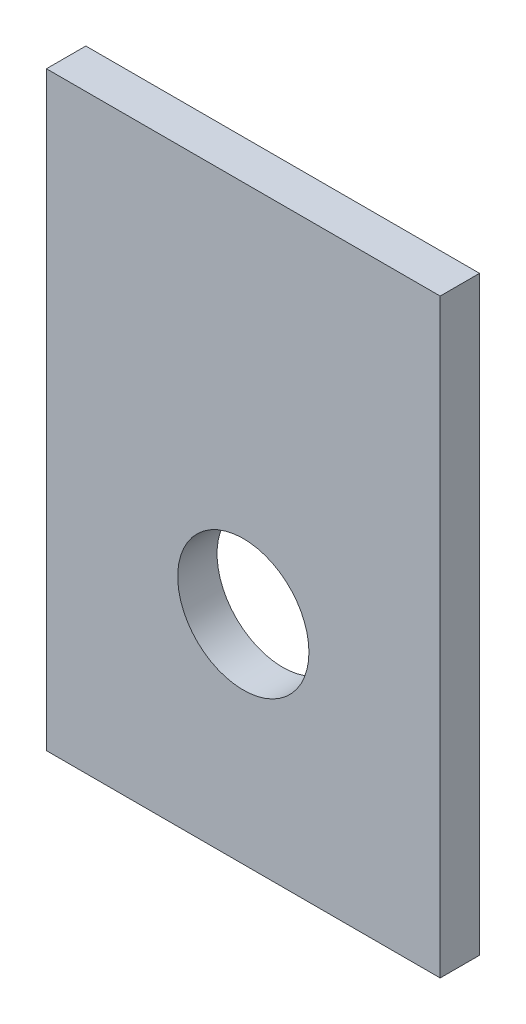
ISO-10303-21;
HEADER;
FILE_DESCRIPTION(('STEP AP214'),'2;1');
FILE_NAME('part.step','',(''),(''),'','','');
FILE_SCHEMA(('AUTOMOTIVE_DESIGN { 1 0 10303 214 1 1 1 1 }'));
ENDSEC;
DATA;
#1=APPLICATION_CONTEXT('core data for automotive mechanical design processes');
#2=APPLICATION_PROTOCOL_DEFINITION('international standard','automotive_design',2000,#1);
#3=PRODUCT_CONTEXT('',#1,'mechanical');
#4=PRODUCT('Part','Part','',(#3));
#5=PRODUCT_RELATED_PRODUCT_CATEGORY('part','',(#4));
#6=PRODUCT_DEFINITION_FORMATION('','',#4);
#7=PRODUCT_DEFINITION_CONTEXT('part definition',#1,'design');
#8=PRODUCT_DEFINITION('design','',#6,#7);
#9=PRODUCT_DEFINITION_SHAPE('','',#8);
#10=(LENGTH_UNIT() NAMED_UNIT(*) SI_UNIT(.MILLI.,.METRE.));
#11=(NAMED_UNIT(*) PLANE_ANGLE_UNIT() SI_UNIT($,.RADIAN.));
#12=(NAMED_UNIT(*) SI_UNIT($,.STERADIAN.) SOLID_ANGLE_UNIT());
#13=UNCERTAINTY_MEASURE_WITH_UNIT(LENGTH_MEASURE(1.E-05),#10,'distance_accuracy_value','');
#14=(GEOMETRIC_REPRESENTATION_CONTEXT(3) GLOBAL_UNCERTAINTY_ASSIGNED_CONTEXT((#13)) GLOBAL_UNIT_ASSIGNED_CONTEXT((#10,
#11,#12)) REPRESENTATION_CONTEXT('',''));
#15=CARTESIAN_POINT('',(0.,0.,0.));
#16=DIRECTION('',(0.,0.,1.));
#17=DIRECTION('',(1.,0.,0.));
#18=AXIS2_PLACEMENT_3D('',#15,#16,#17);
#19=CARTESIAN_POINT('',(-30.,40.,3.));
#20=DIRECTION('',(1.,0.,0.));
#21=DIRECTION('',(0.,0.,-1.));
#22=AXIS2_PLACEMENT_3D('',#19,#20,#21);
#23=PLANE('',#22);
#24=DIRECTION('',(0.,-1.,0.));
#25=VECTOR('',#24,1.);
#26=CARTESIAN_POINT('',(-30.,40.,0.));
#27=LINE('',#26,#25);
#28=CARTESIAN_POINT('',(-30.,40.,0.));
#29=VERTEX_POINT('',#28);
#30=CARTESIAN_POINT('',(-30.,-5.,0.));
#31=VERTEX_POINT('',#30);
#32=EDGE_CURVE('E71',#29,#31,#27,.T.);
#33=ORIENTED_EDGE('',*,*,#32,.T.);
#34=DIRECTION('',(0.,0.,-1.));
#35=VECTOR('',#34,1.);
#36=CARTESIAN_POINT('',(-30.,-5.,3.));
#37=LINE('',#36,#35);
#38=CARTESIAN_POINT('',(-30.,-5.,3.));
#39=VERTEX_POINT('',#38);
#40=EDGE_CURVE('E11',#39,#31,#37,.T.);
#41=ORIENTED_EDGE('',*,*,#40,.F.);
#42=DIRECTION('',(0.,-1.,0.));
#43=VECTOR('',#42,1.);
#44=CARTESIAN_POINT('',(-30.,40.,3.));
#45=LINE('',#44,#43);
#46=CARTESIAN_POINT('',(-30.,40.,3.));
#47=VERTEX_POINT('',#46);
#48=EDGE_CURVE('E94',#47,#39,#45,.T.);
#49=ORIENTED_EDGE('',*,*,#48,.F.);
#50=DIRECTION('',(0.,0.,-1.));
#51=VECTOR('',#50,1.);
#52=CARTESIAN_POINT('',(-30.,40.,3.));
#53=LINE('',#52,#51);
#54=EDGE_CURVE('E83',#47,#29,#53,.T.);
#55=ORIENTED_EDGE('',*,*,#54,.T.);
#56=EDGE_LOOP('',(#33,#41,#49,#55));
#57=FACE_BOUND('',#56,.T.);
#58=ADVANCED_FACE('F27',(#57),#23,.F.);
#59=CARTESIAN_POINT('',(-30.,-5.,3.));
#60=DIRECTION('',(0.,1.,0.));
#61=DIRECTION('',(0.,0.,1.));
#62=AXIS2_PLACEMENT_3D('',#59,#60,#61);
#63=PLANE('',#62);
#64=DIRECTION('',(1.,0.,0.));
#65=VECTOR('',#64,1.);
#66=CARTESIAN_POINT('',(-30.,-5.,0.));
#67=LINE('',#66,#65);
#68=CARTESIAN_POINT('',(0.,-5.,0.));
#69=VERTEX_POINT('',#68);
#70=EDGE_CURVE('E67',#31,#69,#67,.T.);
#71=ORIENTED_EDGE('',*,*,#70,.T.);
#72=DIRECTION('',(0.,0.,-1.));
#73=VECTOR('',#72,1.);
#74=CARTESIAN_POINT('',(0.,-5.,3.));
#75=LINE('',#74,#73);
#76=CARTESIAN_POINT('',(0.,-5.,3.));
#77=VERTEX_POINT('',#76);
#78=EDGE_CURVE('E34',#77,#69,#75,.T.);
#79=ORIENTED_EDGE('',*,*,#78,.F.);
#80=DIRECTION('',(1.,0.,0.));
#81=VECTOR('',#80,1.);
#82=CARTESIAN_POINT('',(-30.,-5.,3.));
#83=LINE('',#82,#81);
#84=EDGE_CURVE('E79',#39,#77,#83,.T.);
#85=ORIENTED_EDGE('',*,*,#84,.F.);
#86=ORIENTED_EDGE('',*,*,#40,.T.);
#87=EDGE_LOOP('',(#71,#79,#85,#86));
#88=FACE_BOUND('',#87,.T.);
#89=ADVANCED_FACE('F78',(#88),#63,.F.);
#90=CARTESIAN_POINT('',(0.,40.,3.));
#91=DIRECTION('',(-1.,0.,0.));
#92=DIRECTION('',(0.,-1.,0.));
#93=AXIS2_PLACEMENT_3D('',#90,#91,#92);
#94=PLANE('',#93);
#95=DIRECTION('',(0.,1.,0.));
#96=VECTOR('',#95,1.);
#97=CARTESIAN_POINT('',(0.,40.,0.));
#98=LINE('',#97,#96);
#99=CARTESIAN_POINT('',(0.,40.,0.));
#100=VERTEX_POINT('',#99);
#101=EDGE_CURVE('E72',#69,#100,#98,.T.);
#102=ORIENTED_EDGE('',*,*,#101,.T.);
#103=DIRECTION('',(0.,0.,-1.));
#104=VECTOR('',#103,1.);
#105=CARTESIAN_POINT('',(0.,40.,3.));
#106=LINE('',#105,#104);
#107=CARTESIAN_POINT('',(0.,40.,3.));
#108=VERTEX_POINT('',#107);
#109=EDGE_CURVE('E100',#108,#100,#106,.T.);
#110=ORIENTED_EDGE('',*,*,#109,.F.);
#111=DIRECTION('',(0.,1.,0.));
#112=VECTOR('',#111,1.);
#113=CARTESIAN_POINT('',(0.,40.,3.));
#114=LINE('',#113,#112);
#115=EDGE_CURVE('E46',#77,#108,#114,.T.);
#116=ORIENTED_EDGE('',*,*,#115,.F.);
#117=ORIENTED_EDGE('',*,*,#78,.T.);
#118=EDGE_LOOP('',(#102,#110,#116,#117));
#119=FACE_BOUND('',#118,.T.);
#120=ADVANCED_FACE('F103',(#119),#94,.F.);
#121=CARTESIAN_POINT('',(-30.,40.,3.));
#122=DIRECTION('',(0.,-1.,0.));
#123=DIRECTION('',(0.,0.,-1.));
#124=AXIS2_PLACEMENT_3D('',#121,#122,#123);
#125=PLANE('',#124);
#126=DIRECTION('',(-1.,0.,0.));
#127=VECTOR('',#126,1.);
#128=CARTESIAN_POINT('',(-30.,40.,0.));
#129=LINE('',#128,#127);
#130=EDGE_CURVE('E92',#100,#29,#129,.T.);
#131=ORIENTED_EDGE('',*,*,#130,.T.);
#132=ORIENTED_EDGE('',*,*,#54,.F.);
#133=DIRECTION('',(-1.,0.,0.));
#134=VECTOR('',#133,1.);
#135=CARTESIAN_POINT('',(-30.,40.,3.));
#136=LINE('',#135,#134);
#137=EDGE_CURVE('E41',#108,#47,#136,.T.);
#138=ORIENTED_EDGE('',*,*,#137,.F.);
#139=ORIENTED_EDGE('',*,*,#109,.T.);
#140=EDGE_LOOP('',(#131,#132,#138,#139));
#141=FACE_BOUND('',#140,.T.);
#142=ADVANCED_FACE('F105',(#141),#125,.F.);
#143=CARTESIAN_POINT('',(-30.,-5.,3.));
#144=DIRECTION('',(0.,0.,1.));
#145=DIRECTION('',(1.,0.,0.));
#146=AXIS2_PLACEMENT_3D('',#143,#144,#145);
#147=PLANE('',#146);
#148=CARTESIAN_POINT('',(-15.,11.5,3.));
#149=DIRECTION('',(0.,0.,1.));
#150=DIRECTION('',(1.,0.,0.));
#151=AXIS2_PLACEMENT_3D('',#148,#149,#150);
#152=CIRCLE('',#151,5.);
#153=CARTESIAN_POINT('',(-10.,11.5,3.));
#154=VERTEX_POINT('',#153);
#155=EDGE_CURVE('E87',#154,#154,#152,.T.);
#156=ORIENTED_EDGE('',*,*,#155,.F.);
#157=EDGE_LOOP('',(#156));
#158=FACE_BOUND('',#157,.T.);
#159=ORIENTED_EDGE('',*,*,#48,.T.);
#160=ORIENTED_EDGE('',*,*,#84,.T.);
#161=ORIENTED_EDGE('',*,*,#115,.T.);
#162=ORIENTED_EDGE('',*,*,#137,.T.);
#163=EDGE_LOOP('',(#159,#160,#161,#162));
#164=FACE_BOUND('',#163,.T.);
#165=ADVANCED_FACE('F106',(#158,#164),#147,.T.);
#166=CARTESIAN_POINT('',(-30.,-5.,0.));
#167=DIRECTION('',(0.,0.,1.));
#168=DIRECTION('',(1.,0.,0.));
#169=AXIS2_PLACEMENT_3D('',#166,#167,#168);
#170=PLANE('',#169);
#171=CARTESIAN_POINT('',(-15.,11.5,0.));
#172=DIRECTION('',(0.,0.,1.));
#173=DIRECTION('',(1.,0.,0.));
#174=AXIS2_PLACEMENT_3D('',#171,#172,#173);
#175=CIRCLE('',#174,5.);
#176=CARTESIAN_POINT('',(-10.,11.5,0.));
#177=VERTEX_POINT('',#176);
#178=EDGE_CURVE('E84',#177,#177,#175,.T.);
#179=ORIENTED_EDGE('',*,*,#178,.T.);
#180=EDGE_LOOP('',(#179));
#181=FACE_BOUND('',#180,.T.);
#182=ORIENTED_EDGE('',*,*,#32,.F.);
#183=ORIENTED_EDGE('',*,*,#130,.F.);
#184=ORIENTED_EDGE('',*,*,#101,.F.);
#185=ORIENTED_EDGE('',*,*,#70,.F.);
#186=EDGE_LOOP('',(#182,#183,#184,#185));
#187=FACE_BOUND('',#186,.T.);
#188=ADVANCED_FACE('F68',(#181,#187),#170,.F.);
#189=CARTESIAN_POINT('',(-15.,11.5,0.));
#190=DIRECTION('',(0.,0.,1.));
#191=DIRECTION('',(1.,0.,0.));
#192=AXIS2_PLACEMENT_3D('',#189,#190,#191);
#193=CYLINDRICAL_SURFACE('',#192,5.);
#194=ORIENTED_EDGE('',*,*,#178,.F.);
#195=EDGE_LOOP('',(#194));
#196=FACE_BOUND('',#195,.T.);
#197=ORIENTED_EDGE('',*,*,#155,.T.);
#198=EDGE_LOOP('',(#197));
#199=FACE_BOUND('',#198,.T.);
#200=ADVANCED_FACE('F114',(#196,#199),#193,.F.);
#201=CLOSED_SHELL('',(#58,#89,#120,#142,#165,#188,#200));
#202=MANIFOLD_SOLID_BREP('B2',#201);
#203=ADVANCED_BREP_SHAPE_REPRESENTATION('',(#18,#202),#14);
#204=SHAPE_DEFINITION_REPRESENTATION(#9,#203);
ENDSEC;
END-ISO-10303-21;
